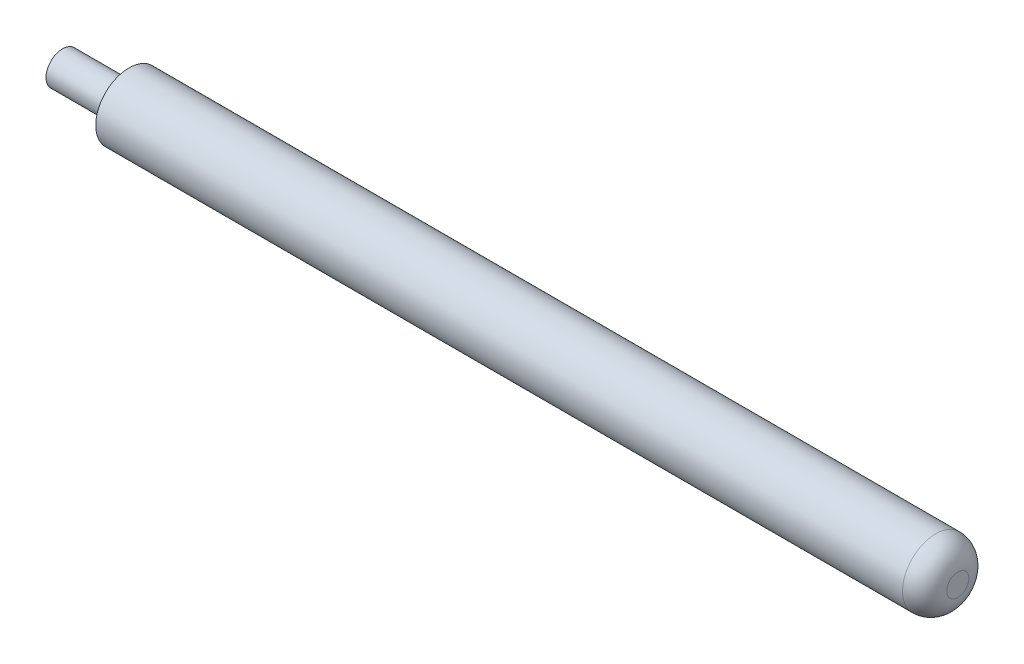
ISO-10303-21;
HEADER;
FILE_DESCRIPTION(('STEP AP214'),'2;1');
FILE_NAME('part.step','',(''),(''),'','','');
FILE_SCHEMA(('AUTOMOTIVE_DESIGN { 1 0 10303 214 1 1 1 1 }'));
ENDSEC;
DATA;
#1=APPLICATION_CONTEXT('core data for automotive mechanical design processes');
#2=APPLICATION_PROTOCOL_DEFINITION('international standard','automotive_design',2000,#1);
#3=PRODUCT_CONTEXT('',#1,'mechanical');
#4=PRODUCT('Part','Part','',(#3));
#5=PRODUCT_RELATED_PRODUCT_CATEGORY('part','',(#4));
#6=PRODUCT_DEFINITION_FORMATION('','',#4);
#7=PRODUCT_DEFINITION_CONTEXT('part definition',#1,'design');
#8=PRODUCT_DEFINITION('design','',#6,#7);
#9=PRODUCT_DEFINITION_SHAPE('','',#8);
#10=(LENGTH_UNIT() NAMED_UNIT(*) SI_UNIT(.MILLI.,.METRE.));
#11=(NAMED_UNIT(*) PLANE_ANGLE_UNIT() SI_UNIT($,.RADIAN.));
#12=(NAMED_UNIT(*) SI_UNIT($,.STERADIAN.) SOLID_ANGLE_UNIT());
#13=UNCERTAINTY_MEASURE_WITH_UNIT(LENGTH_MEASURE(1.E-05),#10,'distance_accuracy_value','');
#14=(GEOMETRIC_REPRESENTATION_CONTEXT(3) GLOBAL_UNCERTAINTY_ASSIGNED_CONTEXT((#13)) GLOBAL_UNIT_ASSIGNED_CONTEXT((#10,
#11,#12)) REPRESENTATION_CONTEXT('',''));
#15=CARTESIAN_POINT('',(0.,0.,0.));
#16=DIRECTION('',(0.,0.,1.));
#17=DIRECTION('',(1.,0.,0.));
#18=AXIS2_PLACEMENT_3D('',#15,#16,#17);
#19=CARTESIAN_POINT('',(0.,0.,0.));
#20=DIRECTION('',(1.,0.,0.));
#21=DIRECTION('',(0.,0.,-1.));
#22=AXIS2_PLACEMENT_3D('',#19,#20,#21);
#23=PLANE('',#22);
#24=CARTESIAN_POINT('',(0.,0.,0.));
#25=DIRECTION('',(1.,0.,0.));
#26=DIRECTION('',(0.,0.,-1.));
#27=AXIS2_PLACEMENT_3D('',#24,#25,#26);
#28=CIRCLE('',#27,3.);
#29=CARTESIAN_POINT('',(0.,0.,-3.));
#30=VERTEX_POINT('',#29);
#31=EDGE_CURVE('E45',#30,#30,#28,.T.);
#32=ORIENTED_EDGE('',*,*,#31,.F.);
#33=EDGE_LOOP('',(#32));
#34=FACE_BOUND('',#33,.T.);
#35=CARTESIAN_POINT('',(0.,0.,0.));
#36=DIRECTION('',(1.,0.,0.));
#37=DIRECTION('',(0.,0.,-1.));
#38=AXIS2_PLACEMENT_3D('',#35,#36,#37);
#39=CIRCLE('',#38,1.5);
#40=CARTESIAN_POINT('',(0.,0.,-1.5));
#41=VERTEX_POINT('',#40);
#42=EDGE_CURVE('E41',#41,#41,#39,.F.);
#43=ORIENTED_EDGE('',*,*,#42,.F.);
#44=EDGE_LOOP('',(#43));
#45=FACE_BOUND('',#44,.T.);
#46=ADVANCED_FACE('F30',(#34,#45),#23,.F.);
#47=CARTESIAN_POINT('',(75.,0.,0.));
#48=DIRECTION('',(-1.,0.,0.));
#49=DIRECTION('',(0.,0.,1.));
#50=AXIS2_PLACEMENT_3D('',#47,#48,#49);
#51=CYLINDRICAL_SURFACE('',#50,3.);
#52=CARTESIAN_POINT('',(73.,0.,0.));
#53=DIRECTION('',(1.,0.,0.));
#54=DIRECTION('',(0.,0.,-1.));
#55=AXIS2_PLACEMENT_3D('',#52,#53,#54);
#56=CIRCLE('',#55,3.);
#57=CARTESIAN_POINT('',(73.,0.,-3.));
#58=VERTEX_POINT('',#57);
#59=EDGE_CURVE('E10',#58,#58,#56,.F.);
#60=ORIENTED_EDGE('',*,*,#59,.T.);
#61=EDGE_LOOP('',(#60));
#62=FACE_BOUND('',#61,.T.);
#63=ORIENTED_EDGE('',*,*,#31,.T.);
#64=EDGE_LOOP('',(#63));
#65=FACE_BOUND('',#64,.T.);
#66=ADVANCED_FACE('F64',(#62,#65),#51,.T.);
#67=CARTESIAN_POINT('',(75.,0.,0.));
#68=DIRECTION('',(1.,0.,0.));
#69=DIRECTION('',(0.,0.,-1.));
#70=AXIS2_PLACEMENT_3D('',#67,#68,#69);
#71=PLANE('',#70);
#72=CARTESIAN_POINT('',(75.,0.,0.));
#73=DIRECTION('',(1.,0.,0.));
#74=DIRECTION('',(0.,0.,-1.));
#75=AXIS2_PLACEMENT_3D('',#72,#73,#74);
#76=CIRCLE('',#75,1.);
#77=CARTESIAN_POINT('',(75.,0.,-1.));
#78=VERTEX_POINT('',#77);
#79=EDGE_CURVE('E37',#78,#78,#76,.T.);
#80=ORIENTED_EDGE('',*,*,#79,.T.);
#81=EDGE_LOOP('',(#80));
#82=FACE_BOUND('',#81,.T.);
#83=ADVANCED_FACE('F59',(#82),#71,.T.);
#84=CARTESIAN_POINT('',(-6.,0.,0.));
#85=DIRECTION('',(1.,0.,0.));
#86=DIRECTION('',(0.,0.,-1.));
#87=AXIS2_PLACEMENT_3D('',#84,#85,#86);
#88=CYLINDRICAL_SURFACE('',#87,1.5);
#89=CARTESIAN_POINT('',(-6.,0.,0.));
#90=DIRECTION('',(-1.,0.,0.));
#91=DIRECTION('',(0.,0.,1.));
#92=AXIS2_PLACEMENT_3D('',#89,#90,#91);
#93=CIRCLE('',#92,1.5);
#94=CARTESIAN_POINT('',(-6.,0.,1.5));
#95=VERTEX_POINT('',#94);
#96=EDGE_CURVE('E50',#95,#95,#93,.T.);
#97=ORIENTED_EDGE('',*,*,#96,.F.);
#98=EDGE_LOOP('',(#97));
#99=FACE_BOUND('',#98,.T.);
#100=ORIENTED_EDGE('',*,*,#42,.T.);
#101=EDGE_LOOP('',(#100));
#102=FACE_BOUND('',#101,.T.);
#103=ADVANCED_FACE('F56',(#99,#102),#88,.T.);
#104=CARTESIAN_POINT('',(-6.,0.,0.));
#105=DIRECTION('',(-1.,0.,0.));
#106=DIRECTION('',(0.,0.,1.));
#107=AXIS2_PLACEMENT_3D('',#104,#105,#106);
#108=PLANE('',#107);
#109=ORIENTED_EDGE('',*,*,#96,.T.);
#110=EDGE_LOOP('',(#109));
#111=FACE_BOUND('',#110,.T.);
#112=ADVANCED_FACE('F54',(#111),#108,.T.);
#113=CARTESIAN_POINT('',(73.,0.,0.));
#114=DIRECTION('',(1.,0.,0.));
#115=DIRECTION('',(0.,0.,-1.));
#116=AXIS2_PLACEMENT_3D('',#113,#114,#115);
#117=DEGENERATE_TOROIDAL_SURFACE('',#116,1.,2.,.T.);
#118=ORIENTED_EDGE('',*,*,#59,.F.);
#119=EDGE_LOOP('',(#118));
#120=FACE_BOUND('',#119,.T.);
#121=ORIENTED_EDGE('',*,*,#79,.F.);
#122=EDGE_LOOP('',(#121));
#123=FACE_BOUND('',#122,.T.);
#124=ADVANCED_FACE('F32',(#120,#123),#117,.T.);
#125=CLOSED_SHELL('',(#46,#66,#83,#103,#112,#124));
#126=MANIFOLD_SOLID_BREP('B2',#125);
#127=ADVANCED_BREP_SHAPE_REPRESENTATION('',(#18,#126),#14);
#128=SHAPE_DEFINITION_REPRESENTATION(#9,#127);
ENDSEC;
END-ISO-10303-21;
